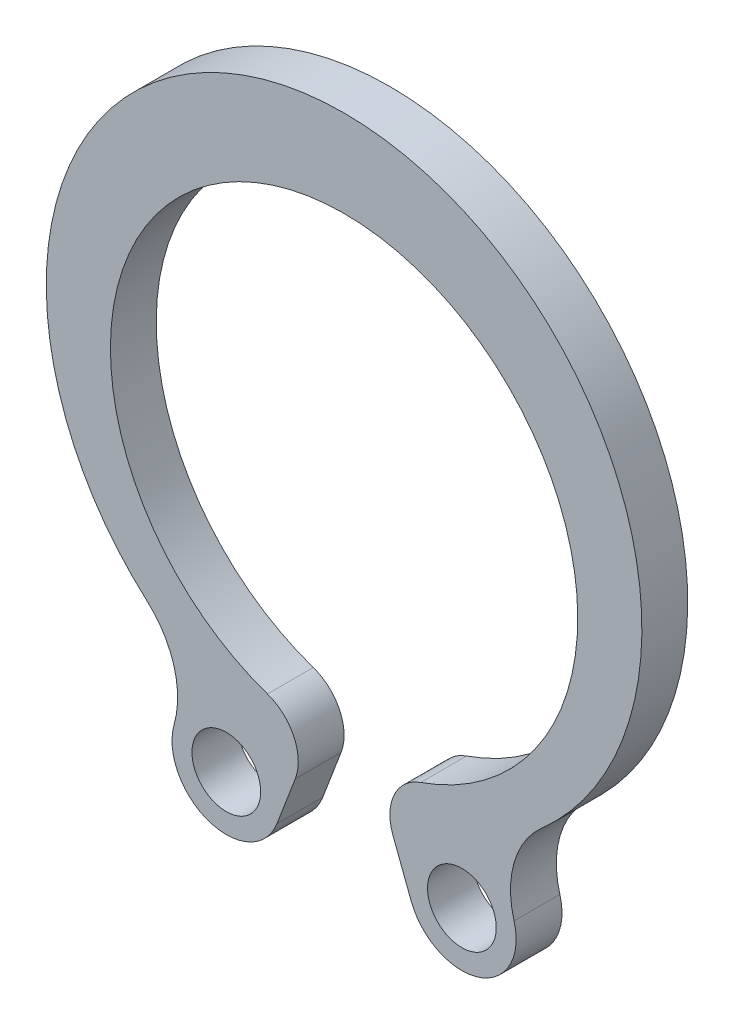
ISO-10303-21;
HEADER;
FILE_DESCRIPTION(('STEP AP214'),'2;1');
FILE_NAME('part.step','',(''),(''),'','','');
FILE_SCHEMA(('AUTOMOTIVE_DESIGN { 1 0 10303 214 1 1 1 1 }'));
ENDSEC;
DATA;
#1=APPLICATION_CONTEXT('core data for automotive mechanical design processes');
#2=APPLICATION_PROTOCOL_DEFINITION('international standard','automotive_design',2000,#1);
#3=PRODUCT_CONTEXT('',#1,'mechanical');
#4=PRODUCT('Part','Part','',(#3));
#5=PRODUCT_RELATED_PRODUCT_CATEGORY('part','',(#4));
#6=PRODUCT_DEFINITION_FORMATION('','',#4);
#7=PRODUCT_DEFINITION_CONTEXT('part definition',#1,'design');
#8=PRODUCT_DEFINITION('design','',#6,#7);
#9=PRODUCT_DEFINITION_SHAPE('','',#8);
#10=(LENGTH_UNIT() NAMED_UNIT(*) SI_UNIT(.MILLI.,.METRE.));
#11=(NAMED_UNIT(*) PLANE_ANGLE_UNIT() SI_UNIT($,.RADIAN.));
#12=(NAMED_UNIT(*) SI_UNIT($,.STERADIAN.) SOLID_ANGLE_UNIT());
#13=UNCERTAINTY_MEASURE_WITH_UNIT(LENGTH_MEASURE(1.E-05),#10,'distance_accuracy_value','');
#14=(GEOMETRIC_REPRESENTATION_CONTEXT(3) GLOBAL_UNCERTAINTY_ASSIGNED_CONTEXT((#13)) GLOBAL_UNIT_ASSIGNED_CONTEXT((#10,
#11,#12)) REPRESENTATION_CONTEXT('',''));
#15=CARTESIAN_POINT('',(0.,0.,0.));
#16=DIRECTION('',(0.,0.,1.));
#17=DIRECTION('',(1.,0.,0.));
#18=AXIS2_PLACEMENT_3D('',#15,#16,#17);
#19=CARTESIAN_POINT('',(-5.63268331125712,-5.86575829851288,1.));
#20=DIRECTION('',(0.,0.,1.));
#21=DIRECTION('',(1.,0.,0.));
#22=AXIS2_PLACEMENT_3D('',#19,#20,#21);
#23=PLANE('',#22);
#24=CARTESIAN_POINT('',(2.57092437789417,-6.7418092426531,1.));
#25=DIRECTION('',(0.,0.,1.));
#26=DIRECTION('',(-1.,0.,0.));
#27=AXIS2_PLACEMENT_3D('',#24,#25,#26);
#28=CIRCLE('',#27,0.749999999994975);
#29=CARTESIAN_POINT('',(1.8209243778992,-6.7418092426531,1.));
#30=VERTEX_POINT('',#29);
#31=EDGE_CURVE('E146',#30,#30,#28,.T.);
#32=ORIENTED_EDGE('',*,*,#31,.F.);
#33=EDGE_LOOP('',(#32));
#34=FACE_BOUND('',#33,.T.);
#35=CARTESIAN_POINT('',(-5.63268331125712,-5.86575829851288,1.));
#36=DIRECTION('',(0.,0.,-1.));
#37=DIRECTION('',(1.,0.,0.));
#38=AXIS2_PLACEMENT_3D('',#35,#36,#37);
#39=CIRCLE('',#38,2.);
#40=CARTESIAN_POINT('',(-4.30734606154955,-4.36793281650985,1.));
#41=VERTEX_POINT('',#40);
#42=CARTESIAN_POINT('',(-3.70984502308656,-6.41593365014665,1.));
#43=VERTEX_POINT('',#42);
#44=EDGE_CURVE('E161',#41,#43,#39,.T.);
#45=ORIENTED_EDGE('',*,*,#44,.T.);
#46=CARTESIAN_POINT('',(-2.57092437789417,-6.7418092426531,1.));
#47=DIRECTION('',(0.,0.,1.));
#48=DIRECTION('',(1.,0.,0.));
#49=AXIS2_PLACEMENT_3D('',#46,#47,#48);
#50=CIRCLE('',#49,1.18462447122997);
#51=CARTESIAN_POINT('',(-1.4640502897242,-7.16390507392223,1.));
#52=VERTEX_POINT('',#51);
#53=EDGE_CURVE('E99',#43,#52,#50,.T.);
#54=ORIENTED_EDGE('',*,*,#53,.T.);
#55=DIRECTION('',(0.356311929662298,0.934367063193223,0.));
#56=VECTOR('',#55,1.);
#57=CARTESIAN_POINT('',(-1.4640502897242,-7.16390507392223,1.));
#58=LINE('',#57,#56);
#59=CARTESIAN_POINT('',(-1.06563293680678,-6.11912374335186,1.));
#60=VERTEX_POINT('',#59);
#61=EDGE_CURVE('E182',#52,#60,#58,.T.);
#62=ORIENTED_EDGE('',*,*,#61,.T.);
#63=CARTESIAN_POINT('',(-2.,-5.76281181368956,1.));
#64=DIRECTION('',(0.,0.,1.));
#65=DIRECTION('',(-1.,0.,0.));
#66=AXIS2_PLACEMENT_3D('',#63,#64,#65);
#67=CIRCLE('',#66,0.999999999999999);
#68=CARTESIAN_POINT('',(-1.67213114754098,-4.81808856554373,1.));
#69=VERTEX_POINT('',#68);
#70=EDGE_CURVE('E201',#60,#69,#67,.T.);
#71=ORIENTED_EDGE('',*,*,#70,.T.);
#72=CARTESIAN_POINT('',(0.,0.,1.));
#73=DIRECTION('',(0.,0.,-1.));
#74=DIRECTION('',(1.,0.,0.));
#75=AXIS2_PLACEMENT_3D('',#72,#73,#74);
#76=CIRCLE('',#75,5.1);
#77=CARTESIAN_POINT('',(1.67213114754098,-4.81808856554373,1.));
#78=VERTEX_POINT('',#77);
#79=EDGE_CURVE('E198',#69,#78,#76,.T.);
#80=ORIENTED_EDGE('',*,*,#79,.T.);
#81=CARTESIAN_POINT('',(2.,-5.76281181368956,1.));
#82=DIRECTION('',(0.,0.,1.));
#83=DIRECTION('',(1.,0.,0.));
#84=AXIS2_PLACEMENT_3D('',#81,#82,#83);
#85=CIRCLE('',#84,0.999999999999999);
#86=CARTESIAN_POINT('',(1.06563293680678,-6.11912374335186,1.));
#87=VERTEX_POINT('',#86);
#88=EDGE_CURVE('E200',#78,#87,#85,.T.);
#89=ORIENTED_EDGE('',*,*,#88,.T.);
#90=DIRECTION('',(0.356311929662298,-0.934367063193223,0.));
#91=VECTOR('',#90,1.);
#92=CARTESIAN_POINT('',(1.06563293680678,-6.11912374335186,1.));
#93=LINE('',#92,#91);
#94=CARTESIAN_POINT('',(1.4640502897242,-7.16390507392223,1.));
#95=VERTEX_POINT('',#94);
#96=EDGE_CURVE('E124',#87,#95,#93,.T.);
#97=ORIENTED_EDGE('',*,*,#96,.T.);
#98=CARTESIAN_POINT('',(2.57092437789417,-6.7418092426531,1.));
#99=DIRECTION('',(0.,0.,1.));
#100=DIRECTION('',(-1.,0.,0.));
#101=AXIS2_PLACEMENT_3D('',#98,#99,#100);
#102=CIRCLE('',#101,1.18462447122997);
#103=CARTESIAN_POINT('',(3.70984502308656,-6.41593365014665,1.));
#104=VERTEX_POINT('',#103);
#105=EDGE_CURVE('E118',#95,#104,#102,.T.);
#106=ORIENTED_EDGE('',*,*,#105,.T.);
#107=CARTESIAN_POINT('',(5.63268331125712,-5.86575829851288,1.));
#108=DIRECTION('',(0.,0.,-1.));
#109=DIRECTION('',(-1.,0.,0.));
#110=AXIS2_PLACEMENT_3D('',#107,#108,#109);
#111=CIRCLE('',#110,2.);
#112=CARTESIAN_POINT('',(4.30734606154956,-4.36793281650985,1.));
#113=VERTEX_POINT('',#112);
#114=EDGE_CURVE('E122',#104,#113,#111,.T.);
#115=ORIENTED_EDGE('',*,*,#114,.T.);
#116=CARTESIAN_POINT('',(0.,0.5,1.));
#117=DIRECTION('',(0.,0.,1.));
#118=DIRECTION('',(-1.,0.,0.));
#119=AXIS2_PLACEMENT_3D('',#116,#117,#118);
#120=CIRCLE('',#119,6.5);
#121=EDGE_CURVE('E50',#113,#41,#120,.T.);
#122=ORIENTED_EDGE('',*,*,#121,.T.);
#123=EDGE_LOOP('',(#45,#54,#62,#71,#80,#89,#97,#106,#115,#122));
#124=FACE_BOUND('',#123,.T.);
#125=CARTESIAN_POINT('',(-2.57092437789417,-6.7418092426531,1.));
#126=DIRECTION('',(0.,0.,1.));
#127=DIRECTION('',(1.,0.,0.));
#128=AXIS2_PLACEMENT_3D('',#125,#126,#127);
#129=CIRCLE('',#128,0.749999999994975);
#130=CARTESIAN_POINT('',(-1.8209243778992,-6.7418092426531,1.));
#131=VERTEX_POINT('',#130);
#132=EDGE_CURVE('E212',#131,#131,#129,.T.);
#133=ORIENTED_EDGE('',*,*,#132,.F.);
#134=EDGE_LOOP('',(#133));
#135=FACE_BOUND('',#134,.T.);
#136=ADVANCED_FACE('F33',(#34,#124,#135),#23,.T.);
#137=CARTESIAN_POINT('',(-5.63268331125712,-5.86575829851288,0.));
#138=DIRECTION('',(0.,0.,1.));
#139=DIRECTION('',(1.,0.,0.));
#140=AXIS2_PLACEMENT_3D('',#137,#138,#139);
#141=PLANE('',#140);
#142=CARTESIAN_POINT('',(-5.63268331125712,-5.86575829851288,0.));
#143=DIRECTION('',(0.,0.,-1.));
#144=DIRECTION('',(1.,0.,0.));
#145=AXIS2_PLACEMENT_3D('',#142,#143,#144);
#146=CIRCLE('',#145,2.);
#147=CARTESIAN_POINT('',(-4.30734606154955,-4.36793281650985,0.));
#148=VERTEX_POINT('',#147);
#149=CARTESIAN_POINT('',(-3.70984502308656,-6.41593365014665,0.));
#150=VERTEX_POINT('',#149);
#151=EDGE_CURVE('E142',#148,#150,#146,.T.);
#152=ORIENTED_EDGE('',*,*,#151,.F.);
#153=CARTESIAN_POINT('',(0.,0.5,0.));
#154=DIRECTION('',(0.,0.,1.));
#155=DIRECTION('',(-1.,0.,0.));
#156=AXIS2_PLACEMENT_3D('',#153,#154,#155);
#157=CIRCLE('',#156,6.5);
#158=CARTESIAN_POINT('',(4.30734606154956,-4.36793281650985,0.));
#159=VERTEX_POINT('',#158);
#160=EDGE_CURVE('E91',#159,#148,#157,.T.);
#161=ORIENTED_EDGE('',*,*,#160,.F.);
#162=CARTESIAN_POINT('',(5.63268331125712,-5.86575829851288,0.));
#163=DIRECTION('',(0.,0.,-1.));
#164=DIRECTION('',(-1.,0.,0.));
#165=AXIS2_PLACEMENT_3D('',#162,#163,#164);
#166=CIRCLE('',#165,2.);
#167=CARTESIAN_POINT('',(3.70984502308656,-6.41593365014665,0.));
#168=VERTEX_POINT('',#167);
#169=EDGE_CURVE('E85',#168,#159,#166,.T.);
#170=ORIENTED_EDGE('',*,*,#169,.F.);
#171=CARTESIAN_POINT('',(2.57092437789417,-6.7418092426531,0.));
#172=DIRECTION('',(0.,0.,1.));
#173=DIRECTION('',(-1.,0.,0.));
#174=AXIS2_PLACEMENT_3D('',#171,#172,#173);
#175=CIRCLE('',#174,1.18462447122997);
#176=CARTESIAN_POINT('',(1.4640502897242,-7.16390507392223,0.));
#177=VERTEX_POINT('',#176);
#178=EDGE_CURVE('E132',#177,#168,#175,.T.);
#179=ORIENTED_EDGE('',*,*,#178,.F.);
#180=DIRECTION('',(0.356311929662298,-0.934367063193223,0.));
#181=VECTOR('',#180,1.);
#182=CARTESIAN_POINT('',(1.06563293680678,-6.11912374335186,0.));
#183=LINE('',#182,#181);
#184=CARTESIAN_POINT('',(1.06563293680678,-6.11912374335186,0.));
#185=VERTEX_POINT('',#184);
#186=EDGE_CURVE('E156',#185,#177,#183,.T.);
#187=ORIENTED_EDGE('',*,*,#186,.F.);
#188=CARTESIAN_POINT('',(2.,-5.76281181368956,0.));
#189=DIRECTION('',(0.,0.,1.));
#190=DIRECTION('',(1.,0.,0.));
#191=AXIS2_PLACEMENT_3D('',#188,#189,#190);
#192=CIRCLE('',#191,0.999999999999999);
#193=CARTESIAN_POINT('',(1.67213114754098,-4.81808856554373,0.));
#194=VERTEX_POINT('',#193);
#195=EDGE_CURVE('E154',#194,#185,#192,.T.);
#196=ORIENTED_EDGE('',*,*,#195,.F.);
#197=CARTESIAN_POINT('',(0.,0.,0.));
#198=DIRECTION('',(0.,0.,-1.));
#199=DIRECTION('',(1.,0.,0.));
#200=AXIS2_PLACEMENT_3D('',#197,#198,#199);
#201=CIRCLE('',#200,5.1);
#202=CARTESIAN_POINT('',(-1.67213114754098,-4.81808856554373,0.));
#203=VERTEX_POINT('',#202);
#204=EDGE_CURVE('E152',#203,#194,#201,.T.);
#205=ORIENTED_EDGE('',*,*,#204,.F.);
#206=CARTESIAN_POINT('',(-2.,-5.76281181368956,0.));
#207=DIRECTION('',(0.,0.,1.));
#208=DIRECTION('',(-1.,0.,0.));
#209=AXIS2_PLACEMENT_3D('',#206,#207,#208);
#210=CIRCLE('',#209,0.999999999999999);
#211=CARTESIAN_POINT('',(-1.06563293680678,-6.11912374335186,0.));
#212=VERTEX_POINT('',#211);
#213=EDGE_CURVE('E150',#212,#203,#210,.T.);
#214=ORIENTED_EDGE('',*,*,#213,.F.);
#215=DIRECTION('',(0.356311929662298,0.934367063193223,0.));
#216=VECTOR('',#215,1.);
#217=CARTESIAN_POINT('',(-1.4640502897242,-7.16390507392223,0.));
#218=LINE('',#217,#216);
#219=CARTESIAN_POINT('',(-1.4640502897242,-7.16390507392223,0.));
#220=VERTEX_POINT('',#219);
#221=EDGE_CURVE('E148',#220,#212,#218,.T.);
#222=ORIENTED_EDGE('',*,*,#221,.F.);
#223=CARTESIAN_POINT('',(-2.57092437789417,-6.7418092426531,0.));
#224=DIRECTION('',(0.,0.,1.));
#225=DIRECTION('',(1.,0.,0.));
#226=AXIS2_PLACEMENT_3D('',#223,#224,#225);
#227=CIRCLE('',#226,1.18462447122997);
#228=EDGE_CURVE('E145',#150,#220,#227,.T.);
#229=ORIENTED_EDGE('',*,*,#228,.F.);
#230=EDGE_LOOP('',(#152,#161,#170,#179,#187,#196,#205,#214,#222,#229));
#231=FACE_BOUND('',#230,.T.);
#232=CARTESIAN_POINT('',(2.57092437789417,-6.7418092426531,0.));
#233=DIRECTION('',(0.,0.,1.));
#234=DIRECTION('',(-1.,0.,0.));
#235=AXIS2_PLACEMENT_3D('',#232,#233,#234);
#236=CIRCLE('',#235,0.749999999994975);
#237=CARTESIAN_POINT('',(1.8209243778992,-6.7418092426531,0.));
#238=VERTEX_POINT('',#237);
#239=EDGE_CURVE('E209',#238,#238,#236,.T.);
#240=ORIENTED_EDGE('',*,*,#239,.T.);
#241=EDGE_LOOP('',(#240));
#242=FACE_BOUND('',#241,.T.);
#243=CARTESIAN_POINT('',(-2.57092437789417,-6.7418092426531,0.));
#244=DIRECTION('',(0.,0.,1.));
#245=DIRECTION('',(1.,0.,0.));
#246=AXIS2_PLACEMENT_3D('',#243,#244,#245);
#247=CIRCLE('',#246,0.749999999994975);
#248=CARTESIAN_POINT('',(-1.8209243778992,-6.7418092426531,0.));
#249=VERTEX_POINT('',#248);
#250=EDGE_CURVE('E215',#249,#249,#247,.T.);
#251=ORIENTED_EDGE('',*,*,#250,.T.);
#252=EDGE_LOOP('',(#251));
#253=FACE_BOUND('',#252,.T.);
#254=ADVANCED_FACE('F186',(#231,#242,#253),#141,.F.);
#255=CARTESIAN_POINT('',(-5.63268331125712,-5.86575829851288,1.));
#256=DIRECTION('',(0.,0.,-1.));
#257=DIRECTION('',(-1.,0.,0.));
#258=AXIS2_PLACEMENT_3D('',#255,#256,#257);
#259=CYLINDRICAL_SURFACE('',#258,2.);
#260=ORIENTED_EDGE('',*,*,#151,.T.);
#261=DIRECTION('',(0.,0.,-1.));
#262=VECTOR('',#261,1.);
#263=CARTESIAN_POINT('',(-3.70984502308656,-6.41593365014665,1.));
#264=LINE('',#263,#262);
#265=EDGE_CURVE('E11',#43,#150,#264,.T.);
#266=ORIENTED_EDGE('',*,*,#265,.F.);
#267=ORIENTED_EDGE('',*,*,#44,.F.);
#268=DIRECTION('',(0.,0.,-1.));
#269=VECTOR('',#268,1.);
#270=CARTESIAN_POINT('',(-4.30734606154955,-4.36793281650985,1.));
#271=LINE('',#270,#269);
#272=EDGE_CURVE('E138',#41,#148,#271,.T.);
#273=ORIENTED_EDGE('',*,*,#272,.T.);
#274=EDGE_LOOP('',(#260,#266,#267,#273));
#275=FACE_BOUND('',#274,.T.);
#276=ADVANCED_FACE('F35',(#275),#259,.F.);
#277=CARTESIAN_POINT('',(-2.57092437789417,-6.7418092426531,1.));
#278=DIRECTION('',(0.,0.,-1.));
#279=DIRECTION('',(-1.,0.,0.));
#280=AXIS2_PLACEMENT_3D('',#277,#278,#279);
#281=CYLINDRICAL_SURFACE('',#280,1.18462447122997);
#282=ORIENTED_EDGE('',*,*,#228,.T.);
#283=DIRECTION('',(0.,0.,-1.));
#284=VECTOR('',#283,1.);
#285=CARTESIAN_POINT('',(-1.4640502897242,-7.16390507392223,1.));
#286=LINE('',#285,#284);
#287=EDGE_CURVE('E42',#52,#220,#286,.T.);
#288=ORIENTED_EDGE('',*,*,#287,.F.);
#289=ORIENTED_EDGE('',*,*,#53,.F.);
#290=ORIENTED_EDGE('',*,*,#265,.T.);
#291=EDGE_LOOP('',(#282,#288,#289,#290));
#292=FACE_BOUND('',#291,.T.);
#293=ADVANCED_FACE('F255',(#292),#281,.T.);
#294=CARTESIAN_POINT('',(-1.4640502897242,-7.16390507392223,1.));
#295=DIRECTION('',(-0.934367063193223,0.356311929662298,0.));
#296=DIRECTION('',(-0.356311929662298,-0.934367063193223,0.));
#297=AXIS2_PLACEMENT_3D('',#294,#295,#296);
#298=PLANE('',#297);
#299=ORIENTED_EDGE('',*,*,#221,.T.);
#300=DIRECTION('',(0.,0.,-1.));
#301=VECTOR('',#300,1.);
#302=CARTESIAN_POINT('',(-1.06563293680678,-6.11912374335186,1.));
#303=LINE('',#302,#301);
#304=EDGE_CURVE('E174',#60,#212,#303,.T.);
#305=ORIENTED_EDGE('',*,*,#304,.F.);
#306=ORIENTED_EDGE('',*,*,#61,.F.);
#307=ORIENTED_EDGE('',*,*,#287,.T.);
#308=EDGE_LOOP('',(#299,#305,#306,#307));
#309=FACE_BOUND('',#308,.T.);
#310=ADVANCED_FACE('F180',(#309),#298,.F.);
#311=CARTESIAN_POINT('',(-2.,-5.76281181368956,1.));
#312=DIRECTION('',(0.,0.,-1.));
#313=DIRECTION('',(-1.,0.,0.));
#314=AXIS2_PLACEMENT_3D('',#311,#312,#313);
#315=CYLINDRICAL_SURFACE('',#314,0.999999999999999);
#316=ORIENTED_EDGE('',*,*,#213,.T.);
#317=DIRECTION('',(0.,0.,-1.));
#318=VECTOR('',#317,1.);
#319=CARTESIAN_POINT('',(-1.67213114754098,-4.81808856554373,1.));
#320=LINE('',#319,#318);
#321=EDGE_CURVE('E171',#69,#203,#320,.T.);
#322=ORIENTED_EDGE('',*,*,#321,.F.);
#323=ORIENTED_EDGE('',*,*,#70,.F.);
#324=ORIENTED_EDGE('',*,*,#304,.T.);
#325=EDGE_LOOP('',(#316,#322,#323,#324));
#326=FACE_BOUND('',#325,.T.);
#327=ADVANCED_FACE('F192',(#326),#315,.T.);
#328=CARTESIAN_POINT('',(0.,0.,1.));
#329=DIRECTION('',(0.,0.,-1.));
#330=DIRECTION('',(-1.,0.,0.));
#331=AXIS2_PLACEMENT_3D('',#328,#329,#330);
#332=CYLINDRICAL_SURFACE('',#331,5.1);
#333=ORIENTED_EDGE('',*,*,#204,.T.);
#334=DIRECTION('',(0.,0.,-1.));
#335=VECTOR('',#334,1.);
#336=CARTESIAN_POINT('',(1.67213114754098,-4.81808856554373,1.));
#337=LINE('',#336,#335);
#338=EDGE_CURVE('E168',#78,#194,#337,.T.);
#339=ORIENTED_EDGE('',*,*,#338,.F.);
#340=ORIENTED_EDGE('',*,*,#79,.F.);
#341=ORIENTED_EDGE('',*,*,#321,.T.);
#342=EDGE_LOOP('',(#333,#339,#340,#341));
#343=FACE_BOUND('',#342,.T.);
#344=ADVANCED_FACE('F196',(#343),#332,.F.);
#345=CARTESIAN_POINT('',(2.,-5.76281181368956,1.));
#346=DIRECTION('',(0.,0.,-1.));
#347=DIRECTION('',(-1.,0.,0.));
#348=AXIS2_PLACEMENT_3D('',#345,#346,#347);
#349=CYLINDRICAL_SURFACE('',#348,0.999999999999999);
#350=ORIENTED_EDGE('',*,*,#195,.T.);
#351=DIRECTION('',(0.,0.,-1.));
#352=VECTOR('',#351,1.);
#353=CARTESIAN_POINT('',(1.06563293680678,-6.11912374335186,1.));
#354=LINE('',#353,#352);
#355=EDGE_CURVE('E165',#87,#185,#354,.T.);
#356=ORIENTED_EDGE('',*,*,#355,.F.);
#357=ORIENTED_EDGE('',*,*,#88,.F.);
#358=ORIENTED_EDGE('',*,*,#338,.T.);
#359=EDGE_LOOP('',(#350,#356,#357,#358));
#360=FACE_BOUND('',#359,.T.);
#361=ADVANCED_FACE('F245',(#360),#349,.T.);
#362=CARTESIAN_POINT('',(1.06563293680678,-6.11912374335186,1.));
#363=DIRECTION('',(0.934367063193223,0.356311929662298,0.));
#364=DIRECTION('',(-0.356311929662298,0.934367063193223,0.));
#365=AXIS2_PLACEMENT_3D('',#362,#363,#364);
#366=PLANE('',#365);
#367=ORIENTED_EDGE('',*,*,#186,.T.);
#368=DIRECTION('',(0.,0.,-1.));
#369=VECTOR('',#368,1.);
#370=CARTESIAN_POINT('',(1.4640502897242,-7.16390507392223,1.));
#371=LINE('',#370,#369);
#372=EDGE_CURVE('E133',#95,#177,#371,.T.);
#373=ORIENTED_EDGE('',*,*,#372,.F.);
#374=ORIENTED_EDGE('',*,*,#96,.F.);
#375=ORIENTED_EDGE('',*,*,#355,.T.);
#376=EDGE_LOOP('',(#367,#373,#374,#375));
#377=FACE_BOUND('',#376,.T.);
#378=ADVANCED_FACE('F242',(#377),#366,.F.);
#379=CARTESIAN_POINT('',(2.57092437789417,-6.7418092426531,1.));
#380=DIRECTION('',(0.,0.,-1.));
#381=DIRECTION('',(-1.,0.,0.));
#382=AXIS2_PLACEMENT_3D('',#379,#380,#381);
#383=CYLINDRICAL_SURFACE('',#382,1.18462447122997);
#384=ORIENTED_EDGE('',*,*,#178,.T.);
#385=DIRECTION('',(0.,0.,-1.));
#386=VECTOR('',#385,1.);
#387=CARTESIAN_POINT('',(3.70984502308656,-6.41593365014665,1.));
#388=LINE('',#387,#386);
#389=EDGE_CURVE('E129',#104,#168,#388,.T.);
#390=ORIENTED_EDGE('',*,*,#389,.F.);
#391=ORIENTED_EDGE('',*,*,#105,.F.);
#392=ORIENTED_EDGE('',*,*,#372,.T.);
#393=EDGE_LOOP('',(#384,#390,#391,#392));
#394=FACE_BOUND('',#393,.T.);
#395=ADVANCED_FACE('F130',(#394),#383,.T.);
#396=CARTESIAN_POINT('',(5.63268331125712,-5.86575829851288,1.));
#397=DIRECTION('',(0.,0.,-1.));
#398=DIRECTION('',(-1.,0.,0.));
#399=AXIS2_PLACEMENT_3D('',#396,#397,#398);
#400=CYLINDRICAL_SURFACE('',#399,2.);
#401=ORIENTED_EDGE('',*,*,#169,.T.);
#402=DIRECTION('',(0.,0.,-1.));
#403=VECTOR('',#402,1.);
#404=CARTESIAN_POINT('',(4.30734606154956,-4.36793281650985,1.));
#405=LINE('',#404,#403);
#406=EDGE_CURVE('E134',#113,#159,#405,.T.);
#407=ORIENTED_EDGE('',*,*,#406,.F.);
#408=ORIENTED_EDGE('',*,*,#114,.F.);
#409=ORIENTED_EDGE('',*,*,#389,.T.);
#410=EDGE_LOOP('',(#401,#407,#408,#409));
#411=FACE_BOUND('',#410,.T.);
#412=ADVANCED_FACE('F136',(#411),#400,.F.);
#413=CARTESIAN_POINT('',(0.,0.5,1.));
#414=DIRECTION('',(0.,0.,-1.));
#415=DIRECTION('',(-1.,0.,0.));
#416=AXIS2_PLACEMENT_3D('',#413,#414,#415);
#417=CYLINDRICAL_SURFACE('',#416,6.5);
#418=ORIENTED_EDGE('',*,*,#160,.T.);
#419=ORIENTED_EDGE('',*,*,#272,.F.);
#420=ORIENTED_EDGE('',*,*,#121,.F.);
#421=ORIENTED_EDGE('',*,*,#406,.T.);
#422=EDGE_LOOP('',(#418,#419,#420,#421));
#423=FACE_BOUND('',#422,.T.);
#424=ADVANCED_FACE('F235',(#423),#417,.T.);
#425=CARTESIAN_POINT('',(2.57092437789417,-6.7418092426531,1.));
#426=DIRECTION('',(0.,0.,-1.));
#427=DIRECTION('',(-1.,0.,0.));
#428=AXIS2_PLACEMENT_3D('',#425,#426,#427);
#429=CYLINDRICAL_SURFACE('',#428,0.749999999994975);
#430=ORIENTED_EDGE('',*,*,#31,.T.);
#431=EDGE_LOOP('',(#430));
#432=FACE_BOUND('',#431,.T.);
#433=ORIENTED_EDGE('',*,*,#239,.F.);
#434=EDGE_LOOP('',(#433));
#435=FACE_BOUND('',#434,.T.);
#436=ADVANCED_FACE('F232',(#432,#435),#429,.F.);
#437=CARTESIAN_POINT('',(-2.57092437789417,-6.7418092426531,1.));
#438=DIRECTION('',(0.,0.,-1.));
#439=DIRECTION('',(-1.,0.,0.));
#440=AXIS2_PLACEMENT_3D('',#437,#438,#439);
#441=CYLINDRICAL_SURFACE('',#440,0.749999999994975);
#442=ORIENTED_EDGE('',*,*,#132,.T.);
#443=EDGE_LOOP('',(#442));
#444=FACE_BOUND('',#443,.T.);
#445=ORIENTED_EDGE('',*,*,#250,.F.);
#446=EDGE_LOOP('',(#445));
#447=FACE_BOUND('',#446,.T.);
#448=ADVANCED_FACE('F221',(#444,#447),#441,.F.);
#449=CLOSED_SHELL('',(#136,#254,#276,#293,#310,#327,#344,#361,#378,#395,#412,#424,#436,#448));
#450=MANIFOLD_SOLID_BREP('B2',#449);
#451=ADVANCED_BREP_SHAPE_REPRESENTATION('',(#18,#450),#14);
#452=SHAPE_DEFINITION_REPRESENTATION(#9,#451);
ENDSEC;
END-ISO-10303-21;
